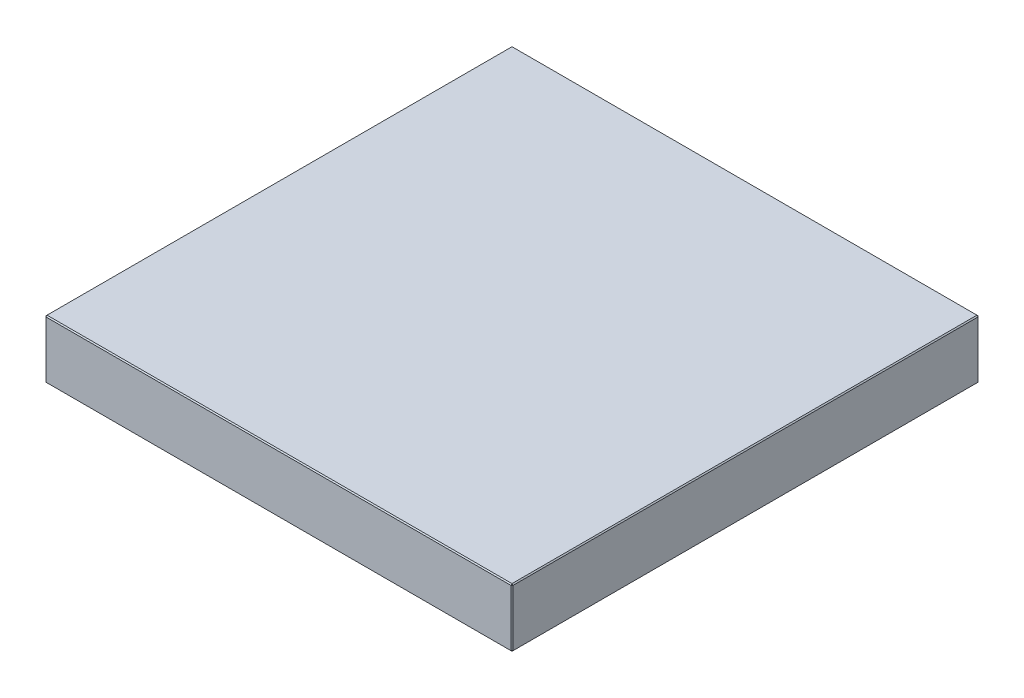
ISO-10303-21;
HEADER;
FILE_DESCRIPTION(('STEP AP214'),'2;1');
FILE_NAME('part.step','',(''),(''),'','','');
FILE_SCHEMA(('AUTOMOTIVE_DESIGN { 1 0 10303 214 1 1 1 1 }'));
ENDSEC;
DATA;
#1=APPLICATION_CONTEXT('core data for automotive mechanical design processes');
#2=APPLICATION_PROTOCOL_DEFINITION('international standard','automotive_design',2000,#1);
#3=PRODUCT_CONTEXT('',#1,'mechanical');
#4=PRODUCT('Part','Part','',(#3));
#5=PRODUCT_RELATED_PRODUCT_CATEGORY('part','',(#4));
#6=PRODUCT_DEFINITION_FORMATION('','',#4);
#7=PRODUCT_DEFINITION_CONTEXT('part definition',#1,'design');
#8=PRODUCT_DEFINITION('design','',#6,#7);
#9=PRODUCT_DEFINITION_SHAPE('','',#8);
#10=(LENGTH_UNIT() NAMED_UNIT(*) SI_UNIT(.MILLI.,.METRE.));
#11=(NAMED_UNIT(*) PLANE_ANGLE_UNIT() SI_UNIT($,.RADIAN.));
#12=(NAMED_UNIT(*) SI_UNIT($,.STERADIAN.) SOLID_ANGLE_UNIT());
#13=UNCERTAINTY_MEASURE_WITH_UNIT(LENGTH_MEASURE(1.E-05),#10,'distance_accuracy_value','');
#14=(GEOMETRIC_REPRESENTATION_CONTEXT(3) GLOBAL_UNCERTAINTY_ASSIGNED_CONTEXT((#13)) GLOBAL_UNIT_ASSIGNED_CONTEXT((#10,
#11,#12)) REPRESENTATION_CONTEXT('',''));
#15=CARTESIAN_POINT('',(0.,0.,0.));
#16=DIRECTION('',(0.,0.,1.));
#17=DIRECTION('',(1.,0.,0.));
#18=AXIS2_PLACEMENT_3D('',#15,#16,#17);
#19=CARTESIAN_POINT('',(-223.,56.,223.));
#20=DIRECTION('',(1.,0.,0.));
#21=DIRECTION('',(0.,0.,-1.));
#22=AXIS2_PLACEMENT_3D('',#19,#20,#21);
#23=PLANE('',#22);
#24=DIRECTION('',(0.,-1.,0.));
#25=VECTOR('',#24,1.);
#26=CARTESIAN_POINT('',(-223.,56.,-222.));
#27=LINE('',#26,#25);
#28=CARTESIAN_POINT('',(-223.,55.,-222.));
#29=VERTEX_POINT('',#28);
#30=CARTESIAN_POINT('',(-223.,0.999999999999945,-222.));
#31=VERTEX_POINT('',#30);
#32=EDGE_CURVE('E114',#29,#31,#27,.T.);
#33=ORIENTED_EDGE('',*,*,#32,.T.);
#34=DIRECTION('',(0.,0.,1.));
#35=VECTOR('',#34,1.);
#36=CARTESIAN_POINT('',(-223.,0.999999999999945,223.));
#37=LINE('',#36,#35);
#38=CARTESIAN_POINT('',(-223.,0.999999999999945,222.));
#39=VERTEX_POINT('',#38);
#40=EDGE_CURVE('E110',#31,#39,#37,.T.);
#41=ORIENTED_EDGE('',*,*,#40,.T.);
#42=DIRECTION('',(0.,1.,0.));
#43=VECTOR('',#42,1.);
#44=CARTESIAN_POINT('',(-223.,56.,222.));
#45=LINE('',#44,#43);
#46=CARTESIAN_POINT('',(-223.,55.,222.));
#47=VERTEX_POINT('',#46);
#48=EDGE_CURVE('E103',#39,#47,#45,.T.);
#49=ORIENTED_EDGE('',*,*,#48,.T.);
#50=DIRECTION('',(0.,0.,-1.));
#51=VECTOR('',#50,1.);
#52=CARTESIAN_POINT('',(-223.,55.,-223.));
#53=LINE('',#52,#51);
#54=EDGE_CURVE('E107',#47,#29,#53,.T.);
#55=ORIENTED_EDGE('',*,*,#54,.T.);
#56=EDGE_LOOP('',(#33,#41,#49,#55));
#57=FACE_BOUND('',#56,.T.);
#58=ADVANCED_FACE('F15',(#57),#23,.F.);
#59=CARTESIAN_POINT('',(223.,56.,223.));
#60=DIRECTION('',(0.,0.,-1.));
#61=DIRECTION('',(-1.,0.,0.));
#62=AXIS2_PLACEMENT_3D('',#59,#60,#61);
#63=PLANE('',#62);
#64=DIRECTION('',(-1.,0.,0.));
#65=VECTOR('',#64,1.);
#66=CARTESIAN_POINT('',(-223.,55.,223.));
#67=LINE('',#66,#65);
#68=CARTESIAN_POINT('',(222.,55.,223.));
#69=VERTEX_POINT('',#68);
#70=CARTESIAN_POINT('',(-222.,55.,223.));
#71=VERTEX_POINT('',#70);
#72=EDGE_CURVE('E164',#69,#71,#67,.T.);
#73=ORIENTED_EDGE('',*,*,#72,.T.);
#74=DIRECTION('',(0.,-1.,0.));
#75=VECTOR('',#74,1.);
#76=CARTESIAN_POINT('',(-222.,56.,223.));
#77=LINE('',#76,#75);
#78=CARTESIAN_POINT('',(-222.,0.999999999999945,223.));
#79=VERTEX_POINT('',#78);
#80=EDGE_CURVE('E122',#71,#79,#77,.T.);
#81=ORIENTED_EDGE('',*,*,#80,.T.);
#82=DIRECTION('',(1.,0.,0.));
#83=VECTOR('',#82,1.);
#84=CARTESIAN_POINT('',(223.,0.999999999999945,223.));
#85=LINE('',#84,#83);
#86=CARTESIAN_POINT('',(222.,0.999999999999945,223.));
#87=VERTEX_POINT('',#86);
#88=EDGE_CURVE('E168',#79,#87,#85,.T.);
#89=ORIENTED_EDGE('',*,*,#88,.T.);
#90=DIRECTION('',(0.,1.,0.));
#91=VECTOR('',#90,1.);
#92=CARTESIAN_POINT('',(222.,56.,223.));
#93=LINE('',#92,#91);
#94=EDGE_CURVE('E166',#87,#69,#93,.T.);
#95=ORIENTED_EDGE('',*,*,#94,.T.);
#96=EDGE_LOOP('',(#73,#81,#89,#95));
#97=FACE_BOUND('',#96,.T.);
#98=ADVANCED_FACE('F275',(#97),#63,.F.);
#99=CARTESIAN_POINT('',(223.,56.,223.));
#100=DIRECTION('',(-1.,0.,0.));
#101=DIRECTION('',(0.,0.,1.));
#102=AXIS2_PLACEMENT_3D('',#99,#100,#101);
#103=PLANE('',#102);
#104=DIRECTION('',(0.,0.,-1.));
#105=VECTOR('',#104,1.);
#106=CARTESIAN_POINT('',(223.,0.999999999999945,223.));
#107=LINE('',#106,#105);
#108=CARTESIAN_POINT('',(223.,0.999999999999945,222.));
#109=VERTEX_POINT('',#108);
#110=CARTESIAN_POINT('',(223.,0.999999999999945,-222.));
#111=VERTEX_POINT('',#110);
#112=EDGE_CURVE('E159',#109,#111,#107,.T.);
#113=ORIENTED_EDGE('',*,*,#112,.T.);
#114=DIRECTION('',(0.,1.,0.));
#115=VECTOR('',#114,1.);
#116=CARTESIAN_POINT('',(223.,56.,-222.));
#117=LINE('',#116,#115);
#118=CARTESIAN_POINT('',(223.,55.,-222.));
#119=VERTEX_POINT('',#118);
#120=EDGE_CURVE('E161',#111,#119,#117,.T.);
#121=ORIENTED_EDGE('',*,*,#120,.T.);
#122=DIRECTION('',(0.,0.,1.));
#123=VECTOR('',#122,1.);
#124=CARTESIAN_POINT('',(223.,55.,223.));
#125=LINE('',#124,#123);
#126=CARTESIAN_POINT('',(223.,55.,222.));
#127=VERTEX_POINT('',#126);
#128=EDGE_CURVE('E155',#119,#127,#125,.T.);
#129=ORIENTED_EDGE('',*,*,#128,.T.);
#130=DIRECTION('',(0.,-1.,0.));
#131=VECTOR('',#130,1.);
#132=CARTESIAN_POINT('',(223.,56.,222.));
#133=LINE('',#132,#131);
#134=EDGE_CURVE('E157',#127,#109,#133,.T.);
#135=ORIENTED_EDGE('',*,*,#134,.T.);
#136=EDGE_LOOP('',(#113,#121,#129,#135));
#137=FACE_BOUND('',#136,.T.);
#138=ADVANCED_FACE('F254',(#137),#103,.F.);
#139=CARTESIAN_POINT('',(223.,56.,-223.));
#140=DIRECTION('',(0.,0.,1.));
#141=DIRECTION('',(1.,0.,0.));
#142=AXIS2_PLACEMENT_3D('',#139,#140,#141);
#143=PLANE('',#142);
#144=DIRECTION('',(0.,-1.,0.));
#145=VECTOR('',#144,1.);
#146=CARTESIAN_POINT('',(222.,56.,-223.));
#147=LINE('',#146,#145);
#148=CARTESIAN_POINT('',(222.,55.,-223.));
#149=VERTEX_POINT('',#148);
#150=CARTESIAN_POINT('',(222.,0.999999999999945,-223.));
#151=VERTEX_POINT('',#150);
#152=EDGE_CURVE('E148',#149,#151,#147,.T.);
#153=ORIENTED_EDGE('',*,*,#152,.T.);
#154=DIRECTION('',(-1.,0.,0.));
#155=VECTOR('',#154,1.);
#156=CARTESIAN_POINT('',(223.,0.999999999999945,-223.));
#157=LINE('',#156,#155);
#158=CARTESIAN_POINT('',(-222.,0.999999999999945,-223.));
#159=VERTEX_POINT('',#158);
#160=EDGE_CURVE('E153',#151,#159,#157,.T.);
#161=ORIENTED_EDGE('',*,*,#160,.T.);
#162=DIRECTION('',(0.,1.,0.));
#163=VECTOR('',#162,1.);
#164=CARTESIAN_POINT('',(-222.,56.,-223.));
#165=LINE('',#164,#163);
#166=CARTESIAN_POINT('',(-222.,55.,-223.));
#167=VERTEX_POINT('',#166);
#168=EDGE_CURVE('E150',#159,#167,#165,.T.);
#169=ORIENTED_EDGE('',*,*,#168,.T.);
#170=DIRECTION('',(1.,0.,0.));
#171=VECTOR('',#170,1.);
#172=CARTESIAN_POINT('',(223.,55.,-223.));
#173=LINE('',#172,#171);
#174=EDGE_CURVE('E146',#167,#149,#173,.T.);
#175=ORIENTED_EDGE('',*,*,#174,.T.);
#176=EDGE_LOOP('',(#153,#161,#169,#175));
#177=FACE_BOUND('',#176,.T.);
#178=ADVANCED_FACE('F284',(#177),#143,.F.);
#179=CARTESIAN_POINT('',(0.,56.,0.));
#180=DIRECTION('',(0.,1.,0.));
#181=DIRECTION('',(0.,0.,1.));
#182=AXIS2_PLACEMENT_3D('',#179,#180,#181);
#183=PLANE('',#182);
#184=DIRECTION('',(0.,0.,-1.));
#185=VECTOR('',#184,1.);
#186=CARTESIAN_POINT('',(222.,56.,-223.));
#187=LINE('',#186,#185);
#188=CARTESIAN_POINT('',(222.,56.,222.));
#189=VERTEX_POINT('',#188);
#190=CARTESIAN_POINT('',(222.,56.,-222.));
#191=VERTEX_POINT('',#190);
#192=EDGE_CURVE('E24',#189,#191,#187,.T.);
#193=ORIENTED_EDGE('',*,*,#192,.T.);
#194=DIRECTION('',(-1.,0.,0.));
#195=VECTOR('',#194,1.);
#196=CARTESIAN_POINT('',(-223.,56.,-222.));
#197=LINE('',#196,#195);
#198=CARTESIAN_POINT('',(-222.,56.,-222.));
#199=VERTEX_POINT('',#198);
#200=EDGE_CURVE('E9',#191,#199,#197,.T.);
#201=ORIENTED_EDGE('',*,*,#200,.T.);
#202=DIRECTION('',(0.,0.,1.));
#203=VECTOR('',#202,1.);
#204=CARTESIAN_POINT('',(-222.,56.,223.));
#205=LINE('',#204,#203);
#206=CARTESIAN_POINT('',(-222.,56.,222.));
#207=VERTEX_POINT('',#206);
#208=EDGE_CURVE('E180',#199,#207,#205,.T.);
#209=ORIENTED_EDGE('',*,*,#208,.T.);
#210=DIRECTION('',(1.,0.,0.));
#211=VECTOR('',#210,1.);
#212=CARTESIAN_POINT('',(223.,56.,222.));
#213=LINE('',#212,#211);
#214=EDGE_CURVE('E35',#207,#189,#213,.T.);
#215=ORIENTED_EDGE('',*,*,#214,.T.);
#216=EDGE_LOOP('',(#193,#201,#209,#215));
#217=FACE_BOUND('',#216,.T.);
#218=ADVANCED_FACE('F350',(#217),#183,.T.);
#219=CARTESIAN_POINT('',(0.,0.,0.));
#220=DIRECTION('',(0.,1.,0.));
#221=DIRECTION('',(0.,0.,1.));
#222=AXIS2_PLACEMENT_3D('',#219,#220,#221);
#223=PLANE('',#222);
#224=DIRECTION('',(0.,0.,1.));
#225=VECTOR('',#224,1.);
#226=CARTESIAN_POINT('',(222.,0.,0.));
#227=LINE('',#226,#225);
#228=CARTESIAN_POINT('',(222.,0.,-222.));
#229=VERTEX_POINT('',#228);
#230=CARTESIAN_POINT('',(222.,0.,222.));
#231=VERTEX_POINT('',#230);
#232=EDGE_CURVE('E171',#229,#231,#227,.T.);
#233=ORIENTED_EDGE('',*,*,#232,.T.);
#234=DIRECTION('',(-1.,0.,0.));
#235=VECTOR('',#234,1.);
#236=CARTESIAN_POINT('',(0.,0.,222.));
#237=LINE('',#236,#235);
#238=CARTESIAN_POINT('',(-222.,0.,222.));
#239=VERTEX_POINT('',#238);
#240=EDGE_CURVE('E177',#231,#239,#237,.T.);
#241=ORIENTED_EDGE('',*,*,#240,.T.);
#242=DIRECTION('',(0.,0.,-1.));
#243=VECTOR('',#242,1.);
#244=CARTESIAN_POINT('',(-222.,0.,0.));
#245=LINE('',#244,#243);
#246=CARTESIAN_POINT('',(-222.,0.,-222.));
#247=VERTEX_POINT('',#246);
#248=EDGE_CURVE('E175',#239,#247,#245,.T.);
#249=ORIENTED_EDGE('',*,*,#248,.T.);
#250=DIRECTION('',(1.,0.,0.));
#251=VECTOR('',#250,1.);
#252=CARTESIAN_POINT('',(0.,0.,-222.));
#253=LINE('',#252,#251);
#254=EDGE_CURVE('E173',#247,#229,#253,.T.);
#255=ORIENTED_EDGE('',*,*,#254,.T.);
#256=EDGE_LOOP('',(#233,#241,#249,#255));
#257=FACE_BOUND('',#256,.T.);
#258=ADVANCED_FACE('F246',(#257),#223,.F.);
#259=CARTESIAN_POINT('',(223.,56.,222.));
#260=DIRECTION('',(-0.707106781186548,0.,-0.707106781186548));
#261=DIRECTION('',(0.,-1.,0.));
#262=AXIS2_PLACEMENT_3D('',#259,#260,#261);
#263=PLANE('',#262);
#264=DIRECTION('',(-0.707106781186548,0.,0.707106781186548));
#265=VECTOR('',#264,1.);
#266=CARTESIAN_POINT('',(222.,55.,223.));
#267=LINE('',#266,#265);
#268=EDGE_CURVE('E19',#69,#127,#267,.F.);
#269=ORIENTED_EDGE('',*,*,#268,.F.);
#270=ORIENTED_EDGE('',*,*,#94,.F.);
#271=DIRECTION('',(0.707106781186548,0.,-0.707106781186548));
#272=VECTOR('',#271,1.);
#273=CARTESIAN_POINT('',(222.,0.999999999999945,223.));
#274=LINE('',#273,#272);
#275=EDGE_CURVE('E142',#109,#87,#274,.F.);
#276=ORIENTED_EDGE('',*,*,#275,.F.);
#277=ORIENTED_EDGE('',*,*,#134,.F.);
#278=EDGE_LOOP('',(#269,#270,#276,#277));
#279=FACE_BOUND('',#278,.T.);
#280=ADVANCED_FACE('F17',(#279),#263,.F.);
#281=CARTESIAN_POINT('',(222.,55.,223.));
#282=DIRECTION('',(0.577350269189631,0.577350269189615,0.577350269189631));
#283=DIRECTION('',(0.707106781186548,0.,-0.707106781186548));
#284=AXIS2_PLACEMENT_3D('',#281,#282,#283);
#285=PLANE('',#284);
#286=DIRECTION('',(0.,-0.707106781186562,0.707106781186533));
#287=VECTOR('',#286,1.);
#288=CARTESIAN_POINT('',(222.,55.,223.));
#289=LINE('',#288,#287);
#290=EDGE_CURVE('E226',#69,#189,#289,.F.);
#291=ORIENTED_EDGE('',*,*,#290,.F.);
#292=ORIENTED_EDGE('',*,*,#268,.T.);
#293=DIRECTION('',(-0.707106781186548,0.707106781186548,0.));
#294=VECTOR('',#293,1.);
#295=CARTESIAN_POINT('',(222.5,55.5,222.));
#296=LINE('',#295,#294);
#297=EDGE_CURVE('E228',#189,#127,#296,.F.);
#298=ORIENTED_EDGE('',*,*,#297,.F.);
#299=EDGE_LOOP('',(#291,#292,#298));
#300=FACE_BOUND('',#299,.T.);
#301=ADVANCED_FACE('F270',(#300),#285,.T.);
#302=CARTESIAN_POINT('',(222.,0.999999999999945,223.));
#303=DIRECTION('',(0.577350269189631,-0.577350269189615,0.577350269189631));
#304=DIRECTION('',(0.707106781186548,0.,-0.707106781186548));
#305=AXIS2_PLACEMENT_3D('',#302,#303,#304);
#306=PLANE('',#305);
#307=DIRECTION('',(-0.707106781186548,-0.707106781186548,0.));
#308=VECTOR('',#307,1.);
#309=CARTESIAN_POINT('',(222.5,0.499999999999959,222.));
#310=LINE('',#309,#308);
#311=EDGE_CURVE('E220',#109,#231,#310,.T.);
#312=ORIENTED_EDGE('',*,*,#311,.F.);
#313=ORIENTED_EDGE('',*,*,#275,.T.);
#314=DIRECTION('',(0.,0.707106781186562,0.707106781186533));
#315=VECTOR('',#314,1.);
#316=CARTESIAN_POINT('',(222.,0.999999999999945,223.));
#317=LINE('',#316,#315);
#318=EDGE_CURVE('E223',#231,#87,#317,.T.);
#319=ORIENTED_EDGE('',*,*,#318,.F.);
#320=EDGE_LOOP('',(#312,#313,#319));
#321=FACE_BOUND('',#320,.T.);
#322=ADVANCED_FACE('F235',(#321),#306,.T.);
#323=CARTESIAN_POINT('',(222.,56.,0.));
#324=DIRECTION('',(0.707106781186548,0.707106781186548,0.));
#325=DIRECTION('',(0.,0.,1.));
#326=AXIS2_PLACEMENT_3D('',#323,#324,#325);
#327=PLANE('',#326);
#328=ORIENTED_EDGE('',*,*,#297,.T.);
#329=ORIENTED_EDGE('',*,*,#128,.F.);
#330=DIRECTION('',(0.707106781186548,-0.707106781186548,0.));
#331=VECTOR('',#330,1.);
#332=CARTESIAN_POINT('',(223.,55.,-222.));
#333=LINE('',#332,#331);
#334=EDGE_CURVE('E215',#191,#119,#333,.T.);
#335=ORIENTED_EDGE('',*,*,#334,.F.);
#336=ORIENTED_EDGE('',*,*,#192,.F.);
#337=EDGE_LOOP('',(#328,#329,#335,#336));
#338=FACE_BOUND('',#337,.T.);
#339=ADVANCED_FACE('F265',(#338),#327,.T.);
#340=CARTESIAN_POINT('',(0.,56.,222.));
#341=DIRECTION('',(0.,0.707106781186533,0.707106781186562));
#342=DIRECTION('',(-1.,0.,0.));
#343=AXIS2_PLACEMENT_3D('',#340,#341,#342);
#344=PLANE('',#343);
#345=ORIENTED_EDGE('',*,*,#290,.T.);
#346=ORIENTED_EDGE('',*,*,#214,.F.);
#347=DIRECTION('',(0.,0.707106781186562,-0.707106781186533));
#348=VECTOR('',#347,1.);
#349=CARTESIAN_POINT('',(-222.,55.5,222.5));
#350=LINE('',#349,#348);
#351=EDGE_CURVE('E126',#71,#207,#350,.T.);
#352=ORIENTED_EDGE('',*,*,#351,.F.);
#353=ORIENTED_EDGE('',*,*,#72,.F.);
#354=EDGE_LOOP('',(#345,#346,#352,#353));
#355=FACE_BOUND('',#354,.T.);
#356=ADVANCED_FACE('F273',(#355),#344,.T.);
#357=CARTESIAN_POINT('',(-222.,56.,223.));
#358=DIRECTION('',(0.707106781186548,0.,-0.707106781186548));
#359=DIRECTION('',(0.,-1.,0.));
#360=AXIS2_PLACEMENT_3D('',#357,#358,#359);
#361=PLANE('',#360);
#362=DIRECTION('',(0.707106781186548,0.,0.707106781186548));
#363=VECTOR('',#362,1.);
#364=CARTESIAN_POINT('',(-222.,0.999999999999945,223.));
#365=LINE('',#364,#363);
#366=EDGE_CURVE('E127',#79,#39,#365,.F.);
#367=ORIENTED_EDGE('',*,*,#366,.F.);
#368=ORIENTED_EDGE('',*,*,#80,.F.);
#369=DIRECTION('',(-0.707106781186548,0.,-0.707106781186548));
#370=VECTOR('',#369,1.);
#371=CARTESIAN_POINT('',(-223.,55.,222.));
#372=LINE('',#371,#370);
#373=EDGE_CURVE('E118',#47,#71,#372,.F.);
#374=ORIENTED_EDGE('',*,*,#373,.F.);
#375=ORIENTED_EDGE('',*,*,#48,.F.);
#376=EDGE_LOOP('',(#367,#368,#374,#375));
#377=FACE_BOUND('',#376,.T.);
#378=ADVANCED_FACE('F120',(#377),#361,.F.);
#379=CARTESIAN_POINT('',(223.,0.999999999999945,223.));
#380=DIRECTION('',(0.,0.707106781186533,-0.707106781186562));
#381=DIRECTION('',(1.,0.,0.));
#382=AXIS2_PLACEMENT_3D('',#379,#380,#381);
#383=PLANE('',#382);
#384=ORIENTED_EDGE('',*,*,#318,.T.);
#385=ORIENTED_EDGE('',*,*,#88,.F.);
#386=DIRECTION('',(0.,-0.707106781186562,-0.707106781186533));
#387=VECTOR('',#386,1.);
#388=CARTESIAN_POINT('',(-222.,0.999999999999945,223.));
#389=LINE('',#388,#387);
#390=EDGE_CURVE('E211',#239,#79,#389,.F.);
#391=ORIENTED_EDGE('',*,*,#390,.F.);
#392=ORIENTED_EDGE('',*,*,#240,.F.);
#393=EDGE_LOOP('',(#384,#385,#391,#392));
#394=FACE_BOUND('',#393,.T.);
#395=ADVANCED_FACE('F243',(#394),#383,.F.);
#396=CARTESIAN_POINT('',(223.,0.999999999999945,223.));
#397=DIRECTION('',(-0.707106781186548,0.707106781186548,0.));
#398=DIRECTION('',(0.,0.,-1.));
#399=AXIS2_PLACEMENT_3D('',#396,#397,#398);
#400=PLANE('',#399);
#401=ORIENTED_EDGE('',*,*,#311,.T.);
#402=ORIENTED_EDGE('',*,*,#232,.F.);
#403=DIRECTION('',(0.707106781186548,0.707106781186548,0.));
#404=VECTOR('',#403,1.);
#405=CARTESIAN_POINT('',(222.5,0.499999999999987,-222.));
#406=LINE('',#405,#404);
#407=EDGE_CURVE('E208',#111,#229,#406,.F.);
#408=ORIENTED_EDGE('',*,*,#407,.F.);
#409=ORIENTED_EDGE('',*,*,#112,.F.);
#410=EDGE_LOOP('',(#401,#402,#408,#409));
#411=FACE_BOUND('',#410,.T.);
#412=ADVANCED_FACE('F251',(#411),#400,.F.);
#413=CARTESIAN_POINT('',(222.,56.,-223.));
#414=DIRECTION('',(-0.707106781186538,0.,0.707106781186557));
#415=DIRECTION('',(0.,-1.,0.));
#416=AXIS2_PLACEMENT_3D('',#413,#414,#415);
#417=PLANE('',#416);
#418=DIRECTION('',(0.707106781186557,0.,0.707106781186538));
#419=VECTOR('',#418,1.);
#420=CARTESIAN_POINT('',(223.,55.,-222.));
#421=LINE('',#420,#419);
#422=EDGE_CURVE('E217',#119,#149,#421,.F.);
#423=ORIENTED_EDGE('',*,*,#422,.F.);
#424=ORIENTED_EDGE('',*,*,#120,.F.);
#425=DIRECTION('',(-0.707106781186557,0.,-0.707106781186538));
#426=VECTOR('',#425,1.);
#427=CARTESIAN_POINT('',(222.,0.999999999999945,-223.));
#428=LINE('',#427,#426);
#429=EDGE_CURVE('E205',#151,#111,#428,.F.);
#430=ORIENTED_EDGE('',*,*,#429,.F.);
#431=ORIENTED_EDGE('',*,*,#152,.F.);
#432=EDGE_LOOP('',(#423,#424,#430,#431));
#433=FACE_BOUND('',#432,.T.);
#434=ADVANCED_FACE('F258',(#433),#417,.F.);
#435=CARTESIAN_POINT('',(223.,55.,-222.));
#436=DIRECTION('',(0.577350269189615,0.577350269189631,-0.577350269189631));
#437=DIRECTION('',(0.,0.707106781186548,0.707106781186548));
#438=AXIS2_PLACEMENT_3D('',#435,#436,#437);
#439=PLANE('',#438);
#440=ORIENTED_EDGE('',*,*,#334,.T.);
#441=ORIENTED_EDGE('',*,*,#422,.T.);
#442=DIRECTION('',(0.,0.707106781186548,0.707106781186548));
#443=VECTOR('',#442,1.);
#444=CARTESIAN_POINT('',(222.,55.5,-222.5));
#445=LINE('',#444,#443);
#446=EDGE_CURVE('E134',#191,#149,#445,.F.);
#447=ORIENTED_EDGE('',*,*,#446,.F.);
#448=EDGE_LOOP('',(#440,#441,#447));
#449=FACE_BOUND('',#448,.T.);
#450=ADVANCED_FACE('F325',(#449),#439,.T.);
#451=CARTESIAN_POINT('',(-223.,55.,222.));
#452=DIRECTION('',(-0.577350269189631,0.577350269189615,0.577350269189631));
#453=DIRECTION('',(0.707106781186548,0.,0.707106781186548));
#454=AXIS2_PLACEMENT_3D('',#451,#452,#453);
#455=PLANE('',#454);
#456=ORIENTED_EDGE('',*,*,#373,.T.);
#457=ORIENTED_EDGE('',*,*,#351,.T.);
#458=DIRECTION('',(-0.707106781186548,-0.707106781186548,0.));
#459=VECTOR('',#458,1.);
#460=CARTESIAN_POINT('',(-223.,55.,222.));
#461=LINE('',#460,#459);
#462=EDGE_CURVE('E130',#47,#207,#461,.F.);
#463=ORIENTED_EDGE('',*,*,#462,.F.);
#464=EDGE_LOOP('',(#456,#457,#463));
#465=FACE_BOUND('',#464,.T.);
#466=ADVANCED_FACE('F131',(#465),#455,.T.);
#467=CARTESIAN_POINT('',(-222.,0.999999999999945,223.));
#468=DIRECTION('',(-0.577350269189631,-0.577350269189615,0.577350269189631));
#469=DIRECTION('',(0.707106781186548,0.,0.707106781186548));
#470=AXIS2_PLACEMENT_3D('',#467,#468,#469);
#471=PLANE('',#470);
#472=ORIENTED_EDGE('',*,*,#390,.T.);
#473=ORIENTED_EDGE('',*,*,#366,.T.);
#474=DIRECTION('',(-0.707106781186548,0.707106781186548,0.));
#475=VECTOR('',#474,1.);
#476=CARTESIAN_POINT('',(-222.5,0.499999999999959,222.));
#477=LINE('',#476,#475);
#478=EDGE_CURVE('E135',#239,#39,#477,.T.);
#479=ORIENTED_EDGE('',*,*,#478,.F.);
#480=EDGE_LOOP('',(#472,#473,#479));
#481=FACE_BOUND('',#480,.T.);
#482=ADVANCED_FACE('F318',(#481),#471,.T.);
#483=CARTESIAN_POINT('',(222.,0.999999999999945,-223.));
#484=DIRECTION('',(0.577350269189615,-0.577350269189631,-0.577350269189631));
#485=DIRECTION('',(0.,0.707106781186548,-0.707106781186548));
#486=AXIS2_PLACEMENT_3D('',#483,#484,#485);
#487=PLANE('',#486);
#488=ORIENTED_EDGE('',*,*,#429,.T.);
#489=ORIENTED_EDGE('',*,*,#407,.T.);
#490=DIRECTION('',(0.,-0.707106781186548,0.707106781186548));
#491=VECTOR('',#490,1.);
#492=CARTESIAN_POINT('',(222.,0.999999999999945,-223.));
#493=LINE('',#492,#491);
#494=EDGE_CURVE('E198',#151,#229,#493,.T.);
#495=ORIENTED_EDGE('',*,*,#494,.F.);
#496=EDGE_LOOP('',(#488,#489,#495));
#497=FACE_BOUND('',#496,.T.);
#498=ADVANCED_FACE('F314',(#497),#487,.T.);
#499=CARTESIAN_POINT('',(0.,56.,-222.));
#500=DIRECTION('',(0.,0.707106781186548,-0.707106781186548));
#501=DIRECTION('',(1.,0.,0.));
#502=AXIS2_PLACEMENT_3D('',#499,#500,#501);
#503=PLANE('',#502);
#504=ORIENTED_EDGE('',*,*,#446,.T.);
#505=ORIENTED_EDGE('',*,*,#174,.F.);
#506=DIRECTION('',(0.,-0.707106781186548,-0.707106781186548));
#507=VECTOR('',#506,1.);
#508=CARTESIAN_POINT('',(-222.,55.,-223.));
#509=LINE('',#508,#507);
#510=EDGE_CURVE('E195',#199,#167,#509,.T.);
#511=ORIENTED_EDGE('',*,*,#510,.F.);
#512=ORIENTED_EDGE('',*,*,#200,.F.);
#513=EDGE_LOOP('',(#504,#505,#511,#512));
#514=FACE_BOUND('',#513,.T.);
#515=ADVANCED_FACE('F311',(#514),#503,.T.);
#516=CARTESIAN_POINT('',(-222.,56.,0.));
#517=DIRECTION('',(-0.707106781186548,0.707106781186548,0.));
#518=DIRECTION('',(0.,0.,-1.));
#519=AXIS2_PLACEMENT_3D('',#516,#517,#518);
#520=PLANE('',#519);
#521=ORIENTED_EDGE('',*,*,#462,.T.);
#522=ORIENTED_EDGE('',*,*,#208,.F.);
#523=DIRECTION('',(0.707106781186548,0.707106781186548,0.));
#524=VECTOR('',#523,1.);
#525=CARTESIAN_POINT('',(-222.5,55.5,-222.));
#526=LINE('',#525,#524);
#527=EDGE_CURVE('E138',#29,#199,#526,.T.);
#528=ORIENTED_EDGE('',*,*,#527,.F.);
#529=ORIENTED_EDGE('',*,*,#54,.F.);
#530=EDGE_LOOP('',(#521,#522,#528,#529));
#531=FACE_BOUND('',#530,.T.);
#532=ADVANCED_FACE('F137',(#531),#520,.T.);
#533=CARTESIAN_POINT('',(-223.,0.999999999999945,223.));
#534=DIRECTION('',(0.707106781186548,0.707106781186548,0.));
#535=DIRECTION('',(0.,0.,1.));
#536=AXIS2_PLACEMENT_3D('',#533,#534,#535);
#537=PLANE('',#536);
#538=ORIENTED_EDGE('',*,*,#478,.T.);
#539=ORIENTED_EDGE('',*,*,#40,.F.);
#540=DIRECTION('',(0.707106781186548,-0.707106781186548,0.));
#541=VECTOR('',#540,1.);
#542=CARTESIAN_POINT('',(-223.,0.999999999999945,-222.));
#543=LINE('',#542,#541);
#544=EDGE_CURVE('E191',#247,#31,#543,.F.);
#545=ORIENTED_EDGE('',*,*,#544,.F.);
#546=ORIENTED_EDGE('',*,*,#248,.F.);
#547=EDGE_LOOP('',(#538,#539,#545,#546));
#548=FACE_BOUND('',#547,.T.);
#549=ADVANCED_FACE('F304',(#548),#537,.F.);
#550=CARTESIAN_POINT('',(223.,0.999999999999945,-223.));
#551=DIRECTION('',(0.,0.707106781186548,0.707106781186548));
#552=DIRECTION('',(-1.,0.,0.));
#553=AXIS2_PLACEMENT_3D('',#550,#551,#552);
#554=PLANE('',#553);
#555=ORIENTED_EDGE('',*,*,#494,.T.);
#556=ORIENTED_EDGE('',*,*,#254,.F.);
#557=DIRECTION('',(0.,0.707106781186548,-0.707106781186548));
#558=VECTOR('',#557,1.);
#559=CARTESIAN_POINT('',(-222.,0.499999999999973,-222.5));
#560=LINE('',#559,#558);
#561=EDGE_CURVE('E188',#159,#247,#560,.F.);
#562=ORIENTED_EDGE('',*,*,#561,.F.);
#563=ORIENTED_EDGE('',*,*,#160,.F.);
#564=EDGE_LOOP('',(#555,#556,#562,#563));
#565=FACE_BOUND('',#564,.T.);
#566=ADVANCED_FACE('F300',(#565),#554,.F.);
#567=CARTESIAN_POINT('',(-222.,55.,-223.));
#568=DIRECTION('',(-0.577350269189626,0.577350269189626,-0.577350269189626));
#569=DIRECTION('',(-0.707106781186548,0.,0.707106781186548));
#570=AXIS2_PLACEMENT_3D('',#567,#568,#569);
#571=PLANE('',#570);
#572=ORIENTED_EDGE('',*,*,#527,.T.);
#573=ORIENTED_EDGE('',*,*,#510,.T.);
#574=DIRECTION('',(0.707106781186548,0.,-0.707106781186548));
#575=VECTOR('',#574,1.);
#576=CARTESIAN_POINT('',(-222.,55.,-223.));
#577=LINE('',#576,#575);
#578=EDGE_CURVE('E186',#29,#167,#577,.T.);
#579=ORIENTED_EDGE('',*,*,#578,.F.);
#580=EDGE_LOOP('',(#572,#573,#579));
#581=FACE_BOUND('',#580,.T.);
#582=ADVANCED_FACE('F296',(#581),#571,.T.);
#583=CARTESIAN_POINT('',(-223.,0.999999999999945,-222.));
#584=DIRECTION('',(-0.577350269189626,-0.577350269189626,-0.577350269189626));
#585=DIRECTION('',(-0.707106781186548,0.,0.707106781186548));
#586=AXIS2_PLACEMENT_3D('',#583,#584,#585);
#587=PLANE('',#586);
#588=ORIENTED_EDGE('',*,*,#561,.T.);
#589=ORIENTED_EDGE('',*,*,#544,.T.);
#590=DIRECTION('',(-0.707106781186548,0.,0.707106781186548));
#591=VECTOR('',#590,1.);
#592=CARTESIAN_POINT('',(-223.,0.999999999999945,-222.));
#593=LINE('',#592,#591);
#594=EDGE_CURVE('E184',#159,#31,#593,.T.);
#595=ORIENTED_EDGE('',*,*,#594,.F.);
#596=EDGE_LOOP('',(#588,#589,#595));
#597=FACE_BOUND('',#596,.T.);
#598=ADVANCED_FACE('F292',(#597),#587,.T.);
#599=CARTESIAN_POINT('',(-223.,56.,-222.));
#600=DIRECTION('',(0.707106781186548,0.,0.707106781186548));
#601=DIRECTION('',(0.,-1.,0.));
#602=AXIS2_PLACEMENT_3D('',#599,#600,#601);
#603=PLANE('',#602);
#604=ORIENTED_EDGE('',*,*,#578,.T.);
#605=ORIENTED_EDGE('',*,*,#168,.F.);
#606=ORIENTED_EDGE('',*,*,#594,.T.);
#607=ORIENTED_EDGE('',*,*,#32,.F.);
#608=EDGE_LOOP('',(#604,#605,#606,#607));
#609=FACE_BOUND('',#608,.T.);
#610=ADVANCED_FACE('F289',(#609),#603,.F.);
#611=CLOSED_SHELL('',(#58,#98,#138,#178,#218,#258,#280,#301,#322,#339,#356,#378,#395,#412,#434,
#450,#466,#482,#498,#515,#532,#549,#566,#582,#598,#610));
#612=MANIFOLD_SOLID_BREP('B1',#611);
#613=ADVANCED_BREP_SHAPE_REPRESENTATION('',(#18,#612),#14);
#614=SHAPE_DEFINITION_REPRESENTATION(#9,#613);
ENDSEC;
END-ISO-10303-21;
